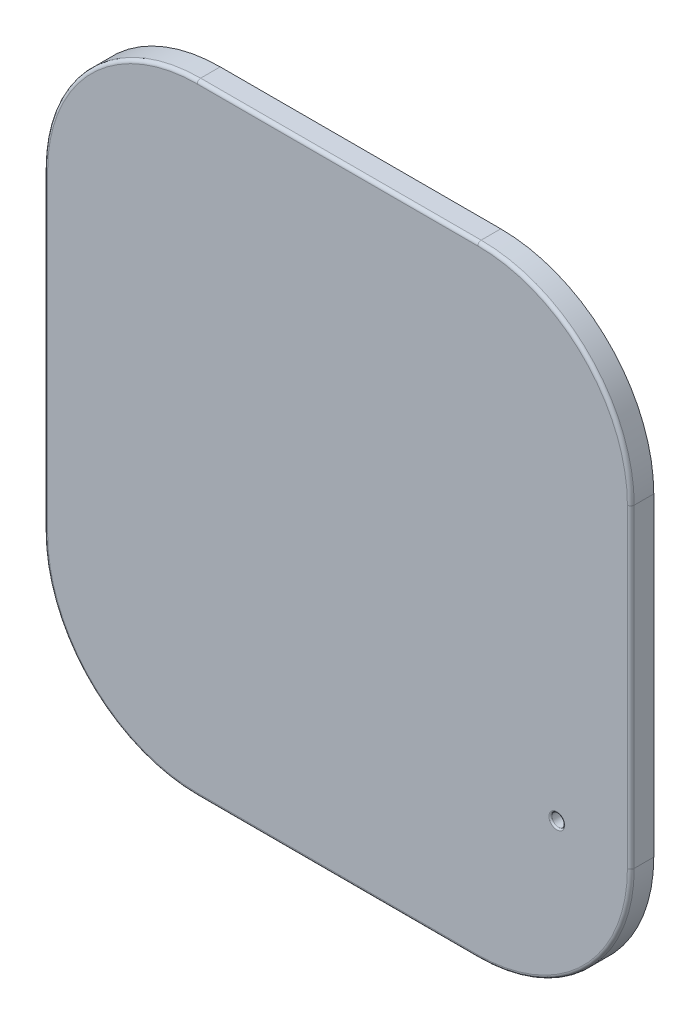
ISO-10303-21;
HEADER;
FILE_DESCRIPTION(('STEP AP214'),'2;1');
FILE_NAME('part.step','',(''),(''),'','','');
FILE_SCHEMA(('AUTOMOTIVE_DESIGN { 1 0 10303 214 1 1 1 1 }'));
ENDSEC;
DATA;
#1=APPLICATION_CONTEXT('core data for automotive mechanical design processes');
#2=APPLICATION_PROTOCOL_DEFINITION('international standard','automotive_design',2000,#1);
#3=PRODUCT_CONTEXT('',#1,'mechanical');
#4=PRODUCT('Part','Part','',(#3));
#5=PRODUCT_RELATED_PRODUCT_CATEGORY('part','',(#4));
#6=PRODUCT_DEFINITION_FORMATION('','',#4);
#7=PRODUCT_DEFINITION_CONTEXT('part definition',#1,'design');
#8=PRODUCT_DEFINITION('design','',#6,#7);
#9=PRODUCT_DEFINITION_SHAPE('','',#8);
#10=(LENGTH_UNIT() NAMED_UNIT(*) SI_UNIT(.MILLI.,.METRE.));
#11=(NAMED_UNIT(*) PLANE_ANGLE_UNIT() SI_UNIT($,.RADIAN.));
#12=(NAMED_UNIT(*) SI_UNIT($,.STERADIAN.) SOLID_ANGLE_UNIT());
#13=UNCERTAINTY_MEASURE_WITH_UNIT(LENGTH_MEASURE(1.E-05),#10,'distance_accuracy_value','');
#14=(GEOMETRIC_REPRESENTATION_CONTEXT(3) GLOBAL_UNCERTAINTY_ASSIGNED_CONTEXT((#13)) GLOBAL_UNIT_ASSIGNED_CONTEXT((#10,
#11,#12)) REPRESENTATION_CONTEXT('',''));
#15=CARTESIAN_POINT('',(0.,0.,0.));
#16=DIRECTION('',(0.,0.,1.));
#17=DIRECTION('',(1.,0.,0.));
#18=AXIS2_PLACEMENT_3D('',#15,#16,#17);
#19=CARTESIAN_POINT('',(-4.34999999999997,48.31,8.35));
#20=DIRECTION('',(0.,0.,1.));
#21=DIRECTION('',(1.,0.,0.));
#22=AXIS2_PLACEMENT_3D('',#19,#20,#21);
#23=PLANE('',#22);
#24=CARTESIAN_POINT('',(-4.34999999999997,48.31,8.35));
#25=DIRECTION('',(0.,0.,-1.));
#26=DIRECTION('',(-1.,0.,0.));
#27=AXIS2_PLACEMENT_3D('',#24,#25,#26);
#28=CIRCLE('',#27,0.285);
#29=CARTESIAN_POINT('',(-4.63499999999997,48.31,8.35));
#30=VERTEX_POINT('',#29);
#31=EDGE_CURVE('E215',#30,#30,#28,.F.);
#32=ORIENTED_EDGE('',*,*,#31,.T.);
#33=EDGE_LOOP('',(#32));
#34=FACE_BOUND('',#33,.T.);
#35=ADVANCED_FACE('F17',(#34),#23,.T.);
#36=CARTESIAN_POINT('',(-4.34999999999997,48.31,8.44));
#37=DIRECTION('',(0.,0.,1.));
#38=DIRECTION('',(1.,0.,0.));
#39=AXIS2_PLACEMENT_3D('',#36,#37,#38);
#40=TOROIDAL_SURFACE('',#39,0.285,0.09);
#41=CARTESIAN_POINT('',(-4.34999999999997,48.31,8.44));
#42=DIRECTION('',(0.,0.,1.));
#43=DIRECTION('',(1.,0.,0.));
#44=AXIS2_PLACEMENT_3D('',#41,#42,#43);
#45=CIRCLE('',#44,0.375);
#46=CARTESIAN_POINT('',(-3.97499999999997,48.31,8.44));
#47=VERTEX_POINT('',#46);
#48=EDGE_CURVE('E210',#47,#47,#45,.T.);
#49=ORIENTED_EDGE('',*,*,#48,.T.);
#50=EDGE_LOOP('',(#49));
#51=FACE_BOUND('',#50,.T.);
#52=ORIENTED_EDGE('',*,*,#31,.F.);
#53=EDGE_LOOP('',(#52));
#54=FACE_BOUND('',#53,.T.);
#55=ADVANCED_FACE('F232',(#51,#54),#40,.F.);
#56=CARTESIAN_POINT('',(-4.34999999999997,48.31,8.35));
#57=DIRECTION('',(0.,0.,1.));
#58=DIRECTION('',(1.,0.,0.));
#59=AXIS2_PLACEMENT_3D('',#56,#57,#58);
#60=CYLINDRICAL_SURFACE('',#59,0.375);
#61=CARTESIAN_POINT('',(-4.34999999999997,48.31,9.26));
#62=DIRECTION('',(0.,0.,-1.));
#63=DIRECTION('',(-1.,0.,0.));
#64=AXIS2_PLACEMENT_3D('',#61,#62,#63);
#65=CIRCLE('',#64,0.375);
#66=CARTESIAN_POINT('',(-4.72499999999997,48.31,9.26));
#67=VERTEX_POINT('',#66);
#68=EDGE_CURVE('E208',#67,#67,#65,.T.);
#69=ORIENTED_EDGE('',*,*,#68,.F.);
#70=EDGE_LOOP('',(#69));
#71=FACE_BOUND('',#70,.T.);
#72=ORIENTED_EDGE('',*,*,#48,.F.);
#73=EDGE_LOOP('',(#72));
#74=FACE_BOUND('',#73,.T.);
#75=ADVANCED_FACE('F235',(#71,#74),#60,.F.);
#76=CARTESIAN_POINT('',(-4.34999999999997,48.31,9.26));
#77=DIRECTION('',(0.,0.,-1.));
#78=DIRECTION('',(-1.,0.,0.));
#79=AXIS2_PLACEMENT_3D('',#76,#77,#78);
#80=TOROIDAL_SURFACE('',#79,0.465,0.09);
#81=ORIENTED_EDGE('',*,*,#68,.T.);
#82=EDGE_LOOP('',(#81));
#83=FACE_BOUND('',#82,.T.);
#84=CARTESIAN_POINT('',(-4.34999999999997,48.31,9.35));
#85=DIRECTION('',(0.,0.,1.));
#86=DIRECTION('',(1.,0.,0.));
#87=AXIS2_PLACEMENT_3D('',#84,#85,#86);
#88=CIRCLE('',#87,0.465);
#89=CARTESIAN_POINT('',(-3.88499999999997,48.31,9.35));
#90=VERTEX_POINT('',#89);
#91=EDGE_CURVE('E128',#90,#90,#88,.T.);
#92=ORIENTED_EDGE('',*,*,#91,.T.);
#93=EDGE_LOOP('',(#92));
#94=FACE_BOUND('',#93,.T.);
#95=ADVANCED_FACE('F168',(#83,#94),#80,.T.);
#96=CARTESIAN_POINT('',(-25.5,47.96,9.35));
#97=DIRECTION('',(0.,0.,-1.));
#98=DIRECTION('',(-1.,0.,0.));
#99=AXIS2_PLACEMENT_3D('',#96,#97,#98);
#100=PLANE('',#99);
#101=ORIENTED_EDGE('',*,*,#91,.F.);
#102=EDGE_LOOP('',(#101));
#103=FACE_BOUND('',#102,.T.);
#104=DIRECTION('',(0.,-1.,0.));
#105=VECTOR('',#104,1.);
#106=CARTESIAN_POINT('',(-34.3,47.96,9.35));
#107=LINE('',#106,#105);
#108=CARTESIAN_POINT('',(-34.3,47.9600000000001,9.35));
#109=VERTEX_POINT('',#108);
#110=CARTESIAN_POINT('',(-34.3,66.4599999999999,9.35));
#111=VERTEX_POINT('',#110);
#112=EDGE_CURVE('E123',#109,#111,#107,.F.);
#113=ORIENTED_EDGE('',*,*,#112,.F.);
#114=CARTESIAN_POINT('',(-25.5,47.96,9.35));
#115=DIRECTION('',(0.,0.,-1.));
#116=DIRECTION('',(0.,-1.,0.));
#117=AXIS2_PLACEMENT_3D('',#114,#115,#116);
#118=CIRCLE('',#117,8.8);
#119=CARTESIAN_POINT('',(-25.4999999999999,39.16,9.35));
#120=VERTEX_POINT('',#119);
#121=EDGE_CURVE('E115',#120,#109,#118,.T.);
#122=ORIENTED_EDGE('',*,*,#121,.F.);
#123=DIRECTION('',(1.,0.,0.));
#124=VECTOR('',#123,1.);
#125=CARTESIAN_POINT('',(-25.5,39.16,9.35));
#126=LINE('',#125,#124);
#127=CARTESIAN_POINT('',(-9.00000000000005,39.16,9.35));
#128=VERTEX_POINT('',#127);
#129=EDGE_CURVE('E121',#128,#120,#126,.F.);
#130=ORIENTED_EDGE('',*,*,#129,.F.);
#131=CARTESIAN_POINT('',(-8.99999999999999,47.96,9.35));
#132=DIRECTION('',(0.,0.,-1.));
#133=DIRECTION('',(1.,0.,0.));
#134=AXIS2_PLACEMENT_3D('',#131,#132,#133);
#135=CIRCLE('',#134,8.8);
#136=CARTESIAN_POINT('',(-0.199999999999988,47.9600000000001,9.35));
#137=VERTEX_POINT('',#136);
#138=EDGE_CURVE('E141',#137,#128,#135,.T.);
#139=ORIENTED_EDGE('',*,*,#138,.F.);
#140=DIRECTION('',(0.,1.,0.));
#141=VECTOR('',#140,1.);
#142=CARTESIAN_POINT('',(-0.199999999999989,47.96,9.35));
#143=LINE('',#142,#141);
#144=CARTESIAN_POINT('',(-0.199999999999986,66.4599999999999,9.35));
#145=VERTEX_POINT('',#144);
#146=EDGE_CURVE('E337',#145,#137,#143,.F.);
#147=ORIENTED_EDGE('',*,*,#146,.F.);
#148=CARTESIAN_POINT('',(-8.99999999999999,66.46,9.35));
#149=DIRECTION('',(0.,0.,-1.));
#150=DIRECTION('',(0.,1.,0.));
#151=AXIS2_PLACEMENT_3D('',#148,#149,#150);
#152=CIRCLE('',#151,8.80000000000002);
#153=CARTESIAN_POINT('',(-9.00000000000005,75.26,9.35));
#154=VERTEX_POINT('',#153);
#155=EDGE_CURVE('E153',#154,#145,#152,.T.);
#156=ORIENTED_EDGE('',*,*,#155,.F.);
#157=DIRECTION('',(-1.,0.,0.));
#158=VECTOR('',#157,1.);
#159=CARTESIAN_POINT('',(-25.5,75.26,9.35000000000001));
#160=LINE('',#159,#158);
#161=CARTESIAN_POINT('',(-25.4999999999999,75.26,9.35));
#162=VERTEX_POINT('',#161);
#163=EDGE_CURVE('E352',#162,#154,#160,.F.);
#164=ORIENTED_EDGE('',*,*,#163,.F.);
#165=CARTESIAN_POINT('',(-25.5,66.46,9.35));
#166=DIRECTION('',(0.,0.,-1.));
#167=DIRECTION('',(-1.,0.,0.));
#168=AXIS2_PLACEMENT_3D('',#165,#166,#167);
#169=CIRCLE('',#168,8.8);
#170=EDGE_CURVE('E195',#111,#162,#169,.T.);
#171=ORIENTED_EDGE('',*,*,#170,.F.);
#172=EDGE_LOOP('',(#113,#122,#130,#139,#147,#156,#164,#171));
#173=FACE_BOUND('',#172,.T.);
#174=ADVANCED_FACE('F118',(#103,#173),#100,.F.);
#175=CARTESIAN_POINT('',(-25.5,47.96,9.15));
#176=DIRECTION('',(0.,0.,-1.));
#177=DIRECTION('',(-1.,0.,0.));
#178=AXIS2_PLACEMENT_3D('',#175,#176,#177);
#179=TOROIDAL_SURFACE('',#178,8.8,0.2);
#180=CARTESIAN_POINT('',(-34.3,47.9600000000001,9.15));
#181=DIRECTION('',(0.,-1.,0.));
#182=DIRECTION('',(1.,0.,0.));
#183=AXIS2_PLACEMENT_3D('',#180,#181,#182);
#184=CIRCLE('',#183,0.199999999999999);
#185=CARTESIAN_POINT('',(-34.5,47.9600000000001,9.15));
#186=VERTEX_POINT('',#185);
#187=EDGE_CURVE('E127',#186,#109,#184,.F.);
#188=ORIENTED_EDGE('',*,*,#187,.F.);
#189=CARTESIAN_POINT('',(-25.5,47.96,9.15));
#190=DIRECTION('',(0.,0.,-1.));
#191=DIRECTION('',(-1.,0.,0.));
#192=AXIS2_PLACEMENT_3D('',#189,#190,#191);
#193=CIRCLE('',#192,8.99999999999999);
#194=CARTESIAN_POINT('',(-25.4999999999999,38.96,9.15));
#195=VERTEX_POINT('',#194);
#196=EDGE_CURVE('E135',#195,#186,#193,.T.);
#197=ORIENTED_EDGE('',*,*,#196,.F.);
#198=CARTESIAN_POINT('',(-25.4999999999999,39.16,9.15));
#199=DIRECTION('',(1.,0.,0.));
#200=DIRECTION('',(0.,1.,0.));
#201=AXIS2_PLACEMENT_3D('',#198,#199,#200);
#202=CIRCLE('',#201,0.199999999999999);
#203=EDGE_CURVE('E132',#120,#195,#202,.T.);
#204=ORIENTED_EDGE('',*,*,#203,.F.);
#205=ORIENTED_EDGE('',*,*,#121,.T.);
#206=EDGE_LOOP('',(#188,#197,#204,#205));
#207=FACE_BOUND('',#206,.T.);
#208=ADVANCED_FACE('F133',(#207),#179,.T.);
#209=CARTESIAN_POINT('',(-34.3,47.96,9.15));
#210=DIRECTION('',(0.,-1.,0.));
#211=DIRECTION('',(1.,0.,0.));
#212=AXIS2_PLACEMENT_3D('',#209,#210,#211);
#213=CYLINDRICAL_SURFACE('',#212,0.199999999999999);
#214=ORIENTED_EDGE('',*,*,#187,.T.);
#215=ORIENTED_EDGE('',*,*,#112,.T.);
#216=CARTESIAN_POINT('',(-34.3,66.46,9.15));
#217=DIRECTION('',(0.,1.,0.));
#218=DIRECTION('',(-1.,0.,0.));
#219=AXIS2_PLACEMENT_3D('',#216,#217,#218);
#220=CIRCLE('',#219,0.2);
#221=CARTESIAN_POINT('',(-34.5,66.46,9.15));
#222=VERTEX_POINT('',#221);
#223=EDGE_CURVE('E390',#222,#111,#220,.T.);
#224=ORIENTED_EDGE('',*,*,#223,.F.);
#225=DIRECTION('',(0.,1.,0.));
#226=VECTOR('',#225,1.);
#227=CARTESIAN_POINT('',(-34.5,66.4599999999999,9.15));
#228=LINE('',#227,#226);
#229=EDGE_CURVE('E304',#222,#186,#228,.F.);
#230=ORIENTED_EDGE('',*,*,#229,.T.);
#231=EDGE_LOOP('',(#214,#215,#224,#230));
#232=FACE_BOUND('',#231,.T.);
#233=ADVANCED_FACE('F395',(#232),#213,.T.);
#234=CARTESIAN_POINT('',(-25.5,66.46,9.15));
#235=DIRECTION('',(0.,0.,-1.));
#236=DIRECTION('',(-1.,0.,0.));
#237=AXIS2_PLACEMENT_3D('',#234,#235,#236);
#238=TOROIDAL_SURFACE('',#237,8.8,0.2);
#239=ORIENTED_EDGE('',*,*,#223,.T.);
#240=ORIENTED_EDGE('',*,*,#170,.T.);
#241=CARTESIAN_POINT('',(-25.4999999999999,75.26,9.15));
#242=DIRECTION('',(-1.,0.,0.));
#243=DIRECTION('',(0.,-1.,0.));
#244=AXIS2_PLACEMENT_3D('',#241,#242,#243);
#245=CIRCLE('',#244,0.200000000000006);
#246=CARTESIAN_POINT('',(-25.4999999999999,75.46,9.15));
#247=VERTEX_POINT('',#246);
#248=EDGE_CURVE('E383',#247,#162,#245,.F.);
#249=ORIENTED_EDGE('',*,*,#248,.F.);
#250=CARTESIAN_POINT('',(-25.5,66.46,9.15));
#251=DIRECTION('',(0.,0.,-1.));
#252=DIRECTION('',(-1.,0.,0.));
#253=AXIS2_PLACEMENT_3D('',#250,#251,#252);
#254=CIRCLE('',#253,9.00000000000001);
#255=EDGE_CURVE('E299',#222,#247,#254,.T.);
#256=ORIENTED_EDGE('',*,*,#255,.F.);
#257=EDGE_LOOP('',(#239,#240,#249,#256));
#258=FACE_BOUND('',#257,.T.);
#259=ADVANCED_FACE('F392',(#258),#238,.T.);
#260=CARTESIAN_POINT('',(-25.5,75.26,9.15));
#261=DIRECTION('',(-1.,0.,0.));
#262=DIRECTION('',(0.,-1.,0.));
#263=AXIS2_PLACEMENT_3D('',#260,#261,#262);
#264=CYLINDRICAL_SURFACE('',#263,0.200000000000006);
#265=ORIENTED_EDGE('',*,*,#248,.T.);
#266=ORIENTED_EDGE('',*,*,#163,.T.);
#267=CARTESIAN_POINT('',(-9.00000000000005,75.26,9.15));
#268=DIRECTION('',(1.,0.,0.));
#269=DIRECTION('',(0.,1.,0.));
#270=AXIS2_PLACEMENT_3D('',#267,#268,#269);
#271=CIRCLE('',#270,0.2);
#272=CARTESIAN_POINT('',(-9.00000000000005,75.46,9.15));
#273=VERTEX_POINT('',#272);
#274=EDGE_CURVE('E371',#273,#154,#271,.T.);
#275=ORIENTED_EDGE('',*,*,#274,.F.);
#276=DIRECTION('',(1.,0.,0.));
#277=VECTOR('',#276,1.);
#278=CARTESIAN_POINT('',(-9.00000000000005,75.46,9.15));
#279=LINE('',#278,#277);
#280=EDGE_CURVE('E293',#273,#247,#279,.F.);
#281=ORIENTED_EDGE('',*,*,#280,.T.);
#282=EDGE_LOOP('',(#265,#266,#275,#281));
#283=FACE_BOUND('',#282,.T.);
#284=ADVANCED_FACE('F364',(#283),#264,.T.);
#285=CARTESIAN_POINT('',(-8.99999999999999,66.46,9.15));
#286=DIRECTION('',(0.,0.,-1.));
#287=DIRECTION('',(-1.,0.,0.));
#288=AXIS2_PLACEMENT_3D('',#285,#286,#287);
#289=TOROIDAL_SURFACE('',#288,8.8,0.2);
#290=ORIENTED_EDGE('',*,*,#274,.T.);
#291=ORIENTED_EDGE('',*,*,#155,.T.);
#292=CARTESIAN_POINT('',(-0.19999999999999,66.4599999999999,9.15));
#293=DIRECTION('',(0.,1.,0.));
#294=DIRECTION('',(-1.,0.,0.));
#295=AXIS2_PLACEMENT_3D('',#292,#293,#294);
#296=CIRCLE('',#295,0.2);
#297=CARTESIAN_POINT('',(0.,66.4599999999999,9.15));
#298=VERTEX_POINT('',#297);
#299=EDGE_CURVE('E344',#298,#145,#296,.F.);
#300=ORIENTED_EDGE('',*,*,#299,.F.);
#301=CARTESIAN_POINT('',(-8.99999999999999,66.46,9.15));
#302=DIRECTION('',(0.,0.,-1.));
#303=DIRECTION('',(-1.,0.,0.));
#304=AXIS2_PLACEMENT_3D('',#301,#302,#303);
#305=CIRCLE('',#304,9.);
#306=EDGE_CURVE('E288',#273,#298,#305,.T.);
#307=ORIENTED_EDGE('',*,*,#306,.F.);
#308=EDGE_LOOP('',(#290,#291,#300,#307));
#309=FACE_BOUND('',#308,.T.);
#310=ADVANCED_FACE('F354',(#309),#289,.T.);
#311=CARTESIAN_POINT('',(-0.199999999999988,47.96,9.15));
#312=DIRECTION('',(0.,1.,0.));
#313=DIRECTION('',(-1.,0.,0.));
#314=AXIS2_PLACEMENT_3D('',#311,#312,#313);
#315=CYLINDRICAL_SURFACE('',#314,0.2);
#316=ORIENTED_EDGE('',*,*,#299,.T.);
#317=ORIENTED_EDGE('',*,*,#146,.T.);
#318=CARTESIAN_POINT('',(-0.199999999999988,47.9600000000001,9.15));
#319=DIRECTION('',(0.,-1.,0.));
#320=DIRECTION('',(1.,0.,0.));
#321=AXIS2_PLACEMENT_3D('',#318,#319,#320);
#322=CIRCLE('',#321,0.2);
#323=CARTESIAN_POINT('',(0.,47.9600000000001,9.15));
#324=VERTEX_POINT('',#323);
#325=EDGE_CURVE('E322',#324,#137,#322,.T.);
#326=ORIENTED_EDGE('',*,*,#325,.F.);
#327=DIRECTION('',(0.,-1.,0.));
#328=VECTOR('',#327,1.);
#329=CARTESIAN_POINT('',(0.,66.4599999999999,9.15));
#330=LINE('',#329,#328);
#331=EDGE_CURVE('E282',#324,#298,#330,.F.);
#332=ORIENTED_EDGE('',*,*,#331,.T.);
#333=EDGE_LOOP('',(#316,#317,#326,#332));
#334=FACE_BOUND('',#333,.T.);
#335=ADVANCED_FACE('F330',(#334),#315,.T.);
#336=CARTESIAN_POINT('',(-8.99999999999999,47.96,9.15));
#337=DIRECTION('',(0.,0.,-1.));
#338=DIRECTION('',(-1.,0.,0.));
#339=AXIS2_PLACEMENT_3D('',#336,#337,#338);
#340=TOROIDAL_SURFACE('',#339,8.8,0.2);
#341=CARTESIAN_POINT('',(-9.00000000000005,39.16,9.15));
#342=DIRECTION('',(1.,0.,0.));
#343=DIRECTION('',(0.,1.,0.));
#344=AXIS2_PLACEMENT_3D('',#341,#342,#343);
#345=CIRCLE('',#344,0.199999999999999);
#346=CARTESIAN_POINT('',(-9.00000000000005,38.96,9.15));
#347=VERTEX_POINT('',#346);
#348=EDGE_CURVE('E68',#347,#128,#345,.F.);
#349=ORIENTED_EDGE('',*,*,#348,.F.);
#350=CARTESIAN_POINT('',(-8.99999999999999,47.96,9.15));
#351=DIRECTION('',(0.,0.,-1.));
#352=DIRECTION('',(-1.,0.,0.));
#353=AXIS2_PLACEMENT_3D('',#350,#351,#352);
#354=CIRCLE('',#353,9.);
#355=EDGE_CURVE('E272',#324,#347,#354,.T.);
#356=ORIENTED_EDGE('',*,*,#355,.F.);
#357=ORIENTED_EDGE('',*,*,#325,.T.);
#358=ORIENTED_EDGE('',*,*,#138,.T.);
#359=EDGE_LOOP('',(#349,#356,#357,#358));
#360=FACE_BOUND('',#359,.T.);
#361=ADVANCED_FACE('F325',(#360),#340,.T.);
#362=CARTESIAN_POINT('',(-25.5,39.16,9.15));
#363=DIRECTION('',(1.,0.,0.));
#364=DIRECTION('',(0.,1.,0.));
#365=AXIS2_PLACEMENT_3D('',#362,#363,#364);
#366=CYLINDRICAL_SURFACE('',#365,0.199999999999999);
#367=ORIENTED_EDGE('',*,*,#203,.T.);
#368=DIRECTION('',(-1.,0.,0.));
#369=VECTOR('',#368,1.);
#370=CARTESIAN_POINT('',(-9.00000000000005,38.96,9.15));
#371=LINE('',#370,#369);
#372=EDGE_CURVE('E267',#195,#347,#371,.F.);
#373=ORIENTED_EDGE('',*,*,#372,.T.);
#374=ORIENTED_EDGE('',*,*,#348,.T.);
#375=ORIENTED_EDGE('',*,*,#129,.T.);
#376=EDGE_LOOP('',(#367,#373,#374,#375));
#377=FACE_BOUND('',#376,.T.);
#378=ADVANCED_FACE('F139',(#377),#366,.T.);
#379=CARTESIAN_POINT('',(-25.5,47.96,9.35));
#380=DIRECTION('',(0.,0.,-1.));
#381=DIRECTION('',(-1.,0.,0.));
#382=AXIS2_PLACEMENT_3D('',#379,#380,#381);
#383=CYLINDRICAL_SURFACE('',#382,8.99999999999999);
#384=DIRECTION('',(0.,0.,1.));
#385=VECTOR('',#384,1.);
#386=CARTESIAN_POINT('',(-34.5,47.9600000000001,9.35));
#387=LINE('',#386,#385);
#388=CARTESIAN_POINT('',(-34.5,47.9600000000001,8.));
#389=VERTEX_POINT('',#388);
#390=EDGE_CURVE('E300',#186,#389,#387,.F.);
#391=ORIENTED_EDGE('',*,*,#390,.T.);
#392=CARTESIAN_POINT('',(-25.5,47.96,8.));
#393=DIRECTION('',(0.,0.,-1.));
#394=DIRECTION('',(-1.,0.,0.));
#395=AXIS2_PLACEMENT_3D('',#392,#393,#394);
#396=CIRCLE('',#395,8.99999999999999);
#397=CARTESIAN_POINT('',(-25.5,38.96,8.));
#398=VERTEX_POINT('',#397);
#399=EDGE_CURVE('E21',#398,#389,#396,.T.);
#400=ORIENTED_EDGE('',*,*,#399,.F.);
#401=DIRECTION('',(0.,0.,1.));
#402=VECTOR('',#401,1.);
#403=CARTESIAN_POINT('',(-25.4999999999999,38.96,9.35));
#404=LINE('',#403,#402);
#405=EDGE_CURVE('E270',#398,#195,#404,.T.);
#406=ORIENTED_EDGE('',*,*,#405,.T.);
#407=ORIENTED_EDGE('',*,*,#196,.T.);
#408=EDGE_LOOP('',(#391,#400,#406,#407));
#409=FACE_BOUND('',#408,.T.);
#410=ADVANCED_FACE('F428',(#409),#383,.T.);
#411=CARTESIAN_POINT('',(-34.5,66.4599999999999,9.35));
#412=DIRECTION('',(1.,0.,0.));
#413=DIRECTION('',(0.,1.,0.));
#414=AXIS2_PLACEMENT_3D('',#411,#412,#413);
#415=PLANE('',#414);
#416=ORIENTED_EDGE('',*,*,#229,.F.);
#417=DIRECTION('',(0.,0.,-1.));
#418=VECTOR('',#417,1.);
#419=CARTESIAN_POINT('',(-34.5,66.46,9.35));
#420=LINE('',#419,#418);
#421=CARTESIAN_POINT('',(-34.5,66.46,8.));
#422=VERTEX_POINT('',#421);
#423=EDGE_CURVE('E296',#422,#222,#420,.F.);
#424=ORIENTED_EDGE('',*,*,#423,.F.);
#425=DIRECTION('',(0.,1.,0.));
#426=VECTOR('',#425,1.);
#427=CARTESIAN_POINT('',(-34.5,47.96,8.));
#428=LINE('',#427,#426);
#429=EDGE_CURVE('E256',#389,#422,#428,.T.);
#430=ORIENTED_EDGE('',*,*,#429,.F.);
#431=ORIENTED_EDGE('',*,*,#390,.F.);
#432=EDGE_LOOP('',(#416,#424,#430,#431));
#433=FACE_BOUND('',#432,.T.);
#434=ADVANCED_FACE('F429',(#433),#415,.F.);
#435=CARTESIAN_POINT('',(-25.5,66.46,9.35));
#436=DIRECTION('',(0.,0.,-1.));
#437=DIRECTION('',(-1.,0.,0.));
#438=AXIS2_PLACEMENT_3D('',#435,#436,#437);
#439=CYLINDRICAL_SURFACE('',#438,9.00000000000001);
#440=DIRECTION('',(0.,0.,1.));
#441=VECTOR('',#440,1.);
#442=CARTESIAN_POINT('',(-25.4999999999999,75.46,9.35));
#443=LINE('',#442,#441);
#444=CARTESIAN_POINT('',(-25.5,75.46,8.));
#445=VERTEX_POINT('',#444);
#446=EDGE_CURVE('E289',#247,#445,#443,.F.);
#447=ORIENTED_EDGE('',*,*,#446,.T.);
#448=CARTESIAN_POINT('',(-25.5,66.46,8.));
#449=DIRECTION('',(0.,0.,-1.));
#450=DIRECTION('',(-1.,0.,0.));
#451=AXIS2_PLACEMENT_3D('',#448,#449,#450);
#452=CIRCLE('',#451,9.00000000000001);
#453=EDGE_CURVE('E254',#422,#445,#452,.T.);
#454=ORIENTED_EDGE('',*,*,#453,.F.);
#455=ORIENTED_EDGE('',*,*,#423,.T.);
#456=ORIENTED_EDGE('',*,*,#255,.T.);
#457=EDGE_LOOP('',(#447,#454,#455,#456));
#458=FACE_BOUND('',#457,.T.);
#459=ADVANCED_FACE('F463',(#458),#439,.T.);
#460=CARTESIAN_POINT('',(-9.00000000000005,75.46,9.35));
#461=DIRECTION('',(0.,-1.,0.));
#462=DIRECTION('',(1.,0.,0.));
#463=AXIS2_PLACEMENT_3D('',#460,#461,#462);
#464=PLANE('',#463);
#465=ORIENTED_EDGE('',*,*,#280,.F.);
#466=DIRECTION('',(0.,0.,-1.));
#467=VECTOR('',#466,1.);
#468=CARTESIAN_POINT('',(-9.00000000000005,75.46,9.35));
#469=LINE('',#468,#467);
#470=CARTESIAN_POINT('',(-9.00000000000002,75.46,8.));
#471=VERTEX_POINT('',#470);
#472=EDGE_CURVE('E285',#471,#273,#469,.F.);
#473=ORIENTED_EDGE('',*,*,#472,.F.);
#474=DIRECTION('',(-1.,0.,0.));
#475=VECTOR('',#474,1.);
#476=CARTESIAN_POINT('',(-25.5,75.46,8.));
#477=LINE('',#476,#475);
#478=EDGE_CURVE('E253',#445,#471,#477,.F.);
#479=ORIENTED_EDGE('',*,*,#478,.F.);
#480=ORIENTED_EDGE('',*,*,#446,.F.);
#481=EDGE_LOOP('',(#465,#473,#479,#480));
#482=FACE_BOUND('',#481,.T.);
#483=ADVANCED_FACE('F459',(#482),#464,.F.);
#484=CARTESIAN_POINT('',(-8.99999999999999,66.46,9.35));
#485=DIRECTION('',(0.,0.,-1.));
#486=DIRECTION('',(-1.,0.,0.));
#487=AXIS2_PLACEMENT_3D('',#484,#485,#486);
#488=CYLINDRICAL_SURFACE('',#487,9.);
#489=DIRECTION('',(0.,0.,1.));
#490=VECTOR('',#489,1.);
#491=CARTESIAN_POINT('',(0.,66.4599999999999,9.35));
#492=LINE('',#491,#490);
#493=CARTESIAN_POINT('',(0.,66.4599999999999,8.));
#494=VERTEX_POINT('',#493);
#495=EDGE_CURVE('E278',#298,#494,#492,.F.);
#496=ORIENTED_EDGE('',*,*,#495,.T.);
#497=CARTESIAN_POINT('',(-8.99999999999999,66.46,8.));
#498=DIRECTION('',(0.,0.,-1.));
#499=DIRECTION('',(-1.,0.,0.));
#500=AXIS2_PLACEMENT_3D('',#497,#498,#499);
#501=CIRCLE('',#500,9.);
#502=EDGE_CURVE('E251',#471,#494,#501,.T.);
#503=ORIENTED_EDGE('',*,*,#502,.F.);
#504=ORIENTED_EDGE('',*,*,#472,.T.);
#505=ORIENTED_EDGE('',*,*,#306,.T.);
#506=EDGE_LOOP('',(#496,#503,#504,#505));
#507=FACE_BOUND('',#506,.T.);
#508=ADVANCED_FACE('F455',(#507),#488,.T.);
#509=CARTESIAN_POINT('',(0.,66.4599999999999,9.35));
#510=DIRECTION('',(-1.,0.,0.));
#511=DIRECTION('',(0.,-1.,0.));
#512=AXIS2_PLACEMENT_3D('',#509,#510,#511);
#513=PLANE('',#512);
#514=ORIENTED_EDGE('',*,*,#331,.F.);
#515=DIRECTION('',(0.,0.,-1.));
#516=VECTOR('',#515,1.);
#517=CARTESIAN_POINT('',(0.,47.9600000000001,9.35));
#518=LINE('',#517,#516);
#519=CARTESIAN_POINT('',(0.,47.9600000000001,8.));
#520=VERTEX_POINT('',#519);
#521=EDGE_CURVE('E275',#520,#324,#518,.F.);
#522=ORIENTED_EDGE('',*,*,#521,.F.);
#523=DIRECTION('',(0.,1.,0.));
#524=VECTOR('',#523,1.);
#525=CARTESIAN_POINT('',(0.,47.96,8.));
#526=LINE('',#525,#524);
#527=EDGE_CURVE('E250',#494,#520,#526,.F.);
#528=ORIENTED_EDGE('',*,*,#527,.F.);
#529=ORIENTED_EDGE('',*,*,#495,.F.);
#530=EDGE_LOOP('',(#514,#522,#528,#529));
#531=FACE_BOUND('',#530,.T.);
#532=ADVANCED_FACE('F443',(#531),#513,.F.);
#533=CARTESIAN_POINT('',(-8.99999999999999,47.96,9.35));
#534=DIRECTION('',(0.,0.,-1.));
#535=DIRECTION('',(-1.,0.,0.));
#536=AXIS2_PLACEMENT_3D('',#533,#534,#535);
#537=CYLINDRICAL_SURFACE('',#536,9.);
#538=DIRECTION('',(0.,0.,1.));
#539=VECTOR('',#538,1.);
#540=CARTESIAN_POINT('',(-9.00000000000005,38.96,9.35));
#541=LINE('',#540,#539);
#542=CARTESIAN_POINT('',(-9.00000000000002,38.96,8.));
#543=VERTEX_POINT('',#542);
#544=EDGE_CURVE('E36',#347,#543,#541,.F.);
#545=ORIENTED_EDGE('',*,*,#544,.T.);
#546=CARTESIAN_POINT('',(-8.99999999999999,47.96,8.));
#547=DIRECTION('',(0.,0.,-1.));
#548=DIRECTION('',(-1.,0.,0.));
#549=AXIS2_PLACEMENT_3D('',#546,#547,#548);
#550=CIRCLE('',#549,9.);
#551=EDGE_CURVE('E27',#520,#543,#550,.T.);
#552=ORIENTED_EDGE('',*,*,#551,.F.);
#553=ORIENTED_EDGE('',*,*,#521,.T.);
#554=ORIENTED_EDGE('',*,*,#355,.T.);
#555=EDGE_LOOP('',(#545,#552,#553,#554));
#556=FACE_BOUND('',#555,.T.);
#557=ADVANCED_FACE('F434',(#556),#537,.T.);
#558=CARTESIAN_POINT('',(-9.00000000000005,38.96,9.35));
#559=DIRECTION('',(0.,1.,0.));
#560=DIRECTION('',(-1.,0.,0.));
#561=AXIS2_PLACEMENT_3D('',#558,#559,#560);
#562=PLANE('',#561);
#563=ORIENTED_EDGE('',*,*,#372,.F.);
#564=ORIENTED_EDGE('',*,*,#405,.F.);
#565=DIRECTION('',(-1.,0.,0.));
#566=VECTOR('',#565,1.);
#567=CARTESIAN_POINT('',(-25.5,38.96,8.));
#568=LINE('',#567,#566);
#569=EDGE_CURVE('E11',#543,#398,#568,.T.);
#570=ORIENTED_EDGE('',*,*,#569,.F.);
#571=ORIENTED_EDGE('',*,*,#544,.F.);
#572=EDGE_LOOP('',(#563,#564,#570,#571));
#573=FACE_BOUND('',#572,.T.);
#574=ADVANCED_FACE('F433',(#573),#562,.F.);
#575=CARTESIAN_POINT('',(-25.5,47.96,8.));
#576=DIRECTION('',(0.,0.,-1.));
#577=DIRECTION('',(-1.,0.,0.));
#578=AXIS2_PLACEMENT_3D('',#575,#576,#577);
#579=PLANE('',#578);
#580=ORIENTED_EDGE('',*,*,#551,.T.);
#581=ORIENTED_EDGE('',*,*,#569,.T.);
#582=ORIENTED_EDGE('',*,*,#399,.T.);
#583=ORIENTED_EDGE('',*,*,#429,.T.);
#584=ORIENTED_EDGE('',*,*,#453,.T.);
#585=ORIENTED_EDGE('',*,*,#478,.T.);
#586=ORIENTED_EDGE('',*,*,#502,.T.);
#587=ORIENTED_EDGE('',*,*,#527,.T.);
#588=EDGE_LOOP('',(#580,#581,#582,#583,#584,#585,#586,#587));
#589=FACE_BOUND('',#588,.T.);
#590=ADVANCED_FACE('F430',(#589),#579,.T.);
#591=CLOSED_SHELL('',(#35,#55,#75,#95,#174,#208,#233,#259,#284,#310,#335,#361,#378,#410,#434,
#459,#483,#508,#532,#557,#574,#590));
#592=MANIFOLD_SOLID_BREP('B1',#591);
#593=ADVANCED_BREP_SHAPE_REPRESENTATION('',(#18,#592),#14);
#594=SHAPE_DEFINITION_REPRESENTATION(#9,#593);
ENDSEC;
END-ISO-10303-21;
